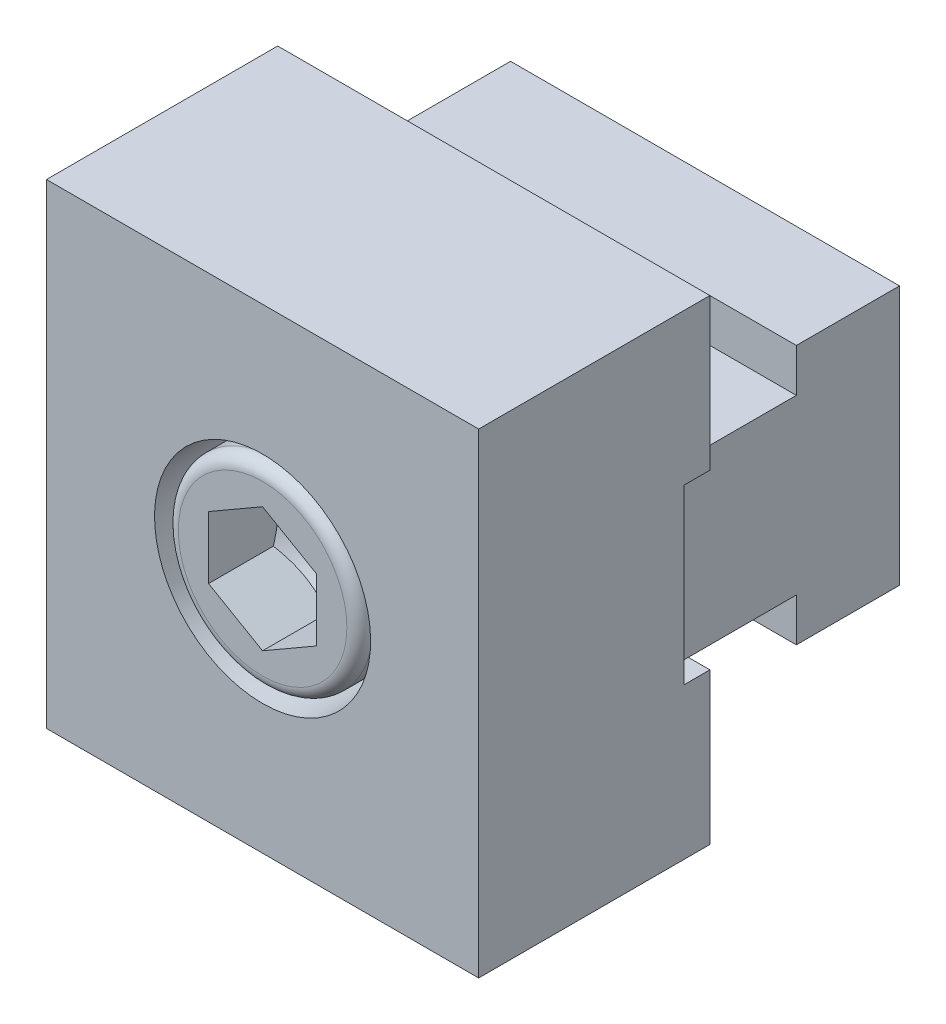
ISO-10303-21;
HEADER;
FILE_DESCRIPTION(('STEP AP214'),'2;1');
FILE_NAME('part.step','',(''),(''),'','','');
FILE_SCHEMA(('AUTOMOTIVE_DESIGN { 1 0 10303 214 1 1 1 1 }'));
ENDSEC;
DATA;
#1=APPLICATION_CONTEXT('core data for automotive mechanical design processes');
#2=APPLICATION_PROTOCOL_DEFINITION('international standard','automotive_design',2000,#1);
#3=PRODUCT_CONTEXT('',#1,'mechanical');
#4=PRODUCT('Part','Part','',(#3));
#5=PRODUCT_RELATED_PRODUCT_CATEGORY('part','',(#4));
#6=PRODUCT_DEFINITION_FORMATION('','',#4);
#7=PRODUCT_DEFINITION_CONTEXT('part definition',#1,'design');
#8=PRODUCT_DEFINITION('design','',#6,#7);
#9=PRODUCT_DEFINITION_SHAPE('','',#8);
#10=(LENGTH_UNIT() NAMED_UNIT(*) SI_UNIT(.MILLI.,.METRE.));
#11=(NAMED_UNIT(*) PLANE_ANGLE_UNIT() SI_UNIT($,.RADIAN.));
#12=(NAMED_UNIT(*) SI_UNIT($,.STERADIAN.) SOLID_ANGLE_UNIT());
#13=UNCERTAINTY_MEASURE_WITH_UNIT(LENGTH_MEASURE(1.E-05),#10,'distance_accuracy_value','');
#14=(GEOMETRIC_REPRESENTATION_CONTEXT(3) GLOBAL_UNCERTAINTY_ASSIGNED_CONTEXT((#13)) GLOBAL_UNIT_ASSIGNED_CONTEXT((#10,
#11,#12)) REPRESENTATION_CONTEXT('',''));
#15=CARTESIAN_POINT('',(0.,0.,0.));
#16=DIRECTION('',(0.,0.,1.));
#17=DIRECTION('',(1.,0.,0.));
#18=AXIS2_PLACEMENT_3D('',#15,#16,#17);
#19=CARTESIAN_POINT('',(0.,0.,-7.7875));
#20=DIRECTION('',(0.,0.,-1.));
#21=DIRECTION('',(-1.,0.,0.));
#22=AXIS2_PLACEMENT_3D('',#19,#20,#21);
#23=CYLINDRICAL_SURFACE('',#22,6.);
#24=CARTESIAN_POINT('',(0.,0.,2.00000000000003));
#25=DIRECTION('',(0.,0.,1.));
#26=DIRECTION('',(0.,-1.,0.));
#27=AXIS2_PLACEMENT_3D('',#24,#25,#26);
#28=CIRCLE('',#27,6.);
#29=CARTESIAN_POINT('',(0.,-5.99999999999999,2.00000000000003));
#30=VERTEX_POINT('',#29);
#31=EDGE_CURVE('E160',#30,#30,#28,.F.);
#32=ORIENTED_EDGE('',*,*,#31,.F.);
#33=EDGE_LOOP('',(#32));
#34=FACE_BOUND('',#33,.T.);
#35=CARTESIAN_POINT('',(0.,0.,2.4));
#36=DIRECTION('',(0.,0.,1.));
#37=DIRECTION('',(1.,0.,0.));
#38=AXIS2_PLACEMENT_3D('',#35,#36,#37);
#39=CIRCLE('',#38,6.);
#40=CARTESIAN_POINT('',(6.,0.,2.4));
#41=VERTEX_POINT('',#40);
#42=EDGE_CURVE('E18',#41,#41,#39,.F.);
#43=ORIENTED_EDGE('',*,*,#42,.T.);
#44=EDGE_LOOP('',(#43));
#45=FACE_BOUND('',#44,.T.);
#46=ADVANCED_FACE('F14',(#34,#45),#23,.T.);
#47=CARTESIAN_POINT('',(-20.,22.,21.4));
#48=DIRECTION('',(0.,0.,1.));
#49=DIRECTION('',(0.,-1.,0.));
#50=AXIS2_PLACEMENT_3D('',#47,#48,#49);
#51=PLANE('',#50);
#52=CARTESIAN_POINT('',(0.,0.,21.4));
#53=DIRECTION('',(0.,0.,1.));
#54=DIRECTION('',(0.,-1.,0.));
#55=AXIS2_PLACEMENT_3D('',#52,#53,#54);
#56=CIRCLE('',#55,10.);
#57=CARTESIAN_POINT('',(0.,-9.99999999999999,21.4));
#58=VERTEX_POINT('',#57);
#59=EDGE_CURVE('E319',#58,#58,#56,.F.);
#60=ORIENTED_EDGE('',*,*,#59,.T.);
#61=EDGE_LOOP('',(#60));
#62=FACE_BOUND('',#61,.T.);
#63=DIRECTION('',(0.,-1.,0.));
#64=VECTOR('',#63,1.);
#65=CARTESIAN_POINT('',(20.,22.,21.4));
#66=LINE('',#65,#64);
#67=CARTESIAN_POINT('',(20.,-22.,21.4));
#68=VERTEX_POINT('',#67);
#69=CARTESIAN_POINT('',(20.,22.,21.4));
#70=VERTEX_POINT('',#69);
#71=EDGE_CURVE('E314',#68,#70,#66,.F.);
#72=ORIENTED_EDGE('',*,*,#71,.T.);
#73=DIRECTION('',(1.,0.,0.));
#74=VECTOR('',#73,1.);
#75=CARTESIAN_POINT('',(-20.,22.,21.4));
#76=LINE('',#75,#74);
#77=CARTESIAN_POINT('',(-20.,22.,21.4));
#78=VERTEX_POINT('',#77);
#79=EDGE_CURVE('E317',#70,#78,#76,.F.);
#80=ORIENTED_EDGE('',*,*,#79,.T.);
#81=DIRECTION('',(0.,-1.,0.));
#82=VECTOR('',#81,1.);
#83=CARTESIAN_POINT('',(-20.,22.,21.4));
#84=LINE('',#83,#82);
#85=CARTESIAN_POINT('',(-20.,-22.,21.4));
#86=VERTEX_POINT('',#85);
#87=EDGE_CURVE('E308',#78,#86,#84,.T.);
#88=ORIENTED_EDGE('',*,*,#87,.T.);
#89=DIRECTION('',(1.,0.,0.));
#90=VECTOR('',#89,1.);
#91=CARTESIAN_POINT('',(-20.,-22.,21.4));
#92=LINE('',#91,#90);
#93=EDGE_CURVE('E311',#86,#68,#92,.T.);
#94=ORIENTED_EDGE('',*,*,#93,.T.);
#95=EDGE_LOOP('',(#72,#80,#88,#94));
#96=FACE_BOUND('',#95,.T.);
#97=ADVANCED_FACE('F477',(#62,#96),#51,.T.);
#98=CARTESIAN_POINT('',(0.,0.,15.4));
#99=DIRECTION('',(0.,0.,1.));
#100=DIRECTION('',(0.,-1.,0.));
#101=AXIS2_PLACEMENT_3D('',#98,#99,#100);
#102=CYLINDRICAL_SURFACE('',#101,10.);
#103=CARTESIAN_POINT('',(0.,0.,9.4));
#104=DIRECTION('',(0.,0.,1.));
#105=DIRECTION('',(0.,-1.,0.));
#106=AXIS2_PLACEMENT_3D('',#103,#104,#105);
#107=CIRCLE('',#106,10.);
#108=CARTESIAN_POINT('',(0.,-9.99999999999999,9.4));
#109=VERTEX_POINT('',#108);
#110=EDGE_CURVE('E307',#109,#109,#107,.T.);
#111=ORIENTED_EDGE('',*,*,#110,.F.);
#112=EDGE_LOOP('',(#111));
#113=FACE_BOUND('',#112,.T.);
#114=ORIENTED_EDGE('',*,*,#59,.F.);
#115=EDGE_LOOP('',(#114));
#116=FACE_BOUND('',#115,.T.);
#117=ADVANCED_FACE('F483',(#113,#116),#102,.F.);
#118=CARTESIAN_POINT('',(0.,0.,9.4));
#119=DIRECTION('',(0.,0.,1.));
#120=DIRECTION('',(0.,-1.,0.));
#121=AXIS2_PLACEMENT_3D('',#118,#119,#120);
#122=PLANE('',#121);
#123=ORIENTED_EDGE('',*,*,#110,.T.);
#124=EDGE_LOOP('',(#123));
#125=FACE_BOUND('',#124,.T.);
#126=CARTESIAN_POINT('',(0.,0.,9.4));
#127=DIRECTION('',(0.,0.,-1.));
#128=DIRECTION('',(-1.,0.,0.));
#129=AXIS2_PLACEMENT_3D('',#126,#127,#128);
#130=CIRCLE('',#129,9.);
#131=CARTESIAN_POINT('',(-9.,0.,9.4));
#132=VERTEX_POINT('',#131);
#133=EDGE_CURVE('E324',#132,#132,#130,.T.);
#134=ORIENTED_EDGE('',*,*,#133,.T.);
#135=EDGE_LOOP('',(#134));
#136=FACE_BOUND('',#135,.T.);
#137=ADVANCED_FACE('F607',(#125,#136),#122,.T.);
#138=CARTESIAN_POINT('',(-20.,-22.,-1.6));
#139=DIRECTION('',(0.,1.,0.));
#140=DIRECTION('',(0.,0.,1.));
#141=AXIS2_PLACEMENT_3D('',#138,#139,#140);
#142=PLANE('',#141);
#143=DIRECTION('',(0.,0.,1.));
#144=VECTOR('',#143,1.);
#145=CARTESIAN_POINT('',(20.,-22.,9.9));
#146=LINE('',#145,#144);
#147=CARTESIAN_POINT('',(20.,-22.,0.));
#148=VERTEX_POINT('',#147);
#149=EDGE_CURVE('E295',#68,#148,#146,.F.);
#150=ORIENTED_EDGE('',*,*,#149,.F.);
#151=ORIENTED_EDGE('',*,*,#93,.F.);
#152=DIRECTION('',(0.,0.,1.));
#153=VECTOR('',#152,1.);
#154=CARTESIAN_POINT('',(-20.,-22.,-1.6));
#155=LINE('',#154,#153);
#156=CARTESIAN_POINT('',(-20.,-22.,0.));
#157=VERTEX_POINT('',#156);
#158=EDGE_CURVE('E275',#157,#86,#155,.T.);
#159=ORIENTED_EDGE('',*,*,#158,.F.);
#160=DIRECTION('',(1.,0.,0.));
#161=VECTOR('',#160,1.);
#162=CARTESIAN_POINT('',(-20.,-22.,0.));
#163=LINE('',#162,#161);
#164=EDGE_CURVE('E278',#148,#157,#163,.F.);
#165=ORIENTED_EDGE('',*,*,#164,.F.);
#166=EDGE_LOOP('',(#150,#151,#159,#165));
#167=FACE_BOUND('',#166,.T.);
#168=ADVANCED_FACE('F598',(#167),#142,.F.);
#169=CARTESIAN_POINT('',(-20.,8.,2.4));
#170=DIRECTION('',(0.,0.,1.));
#171=DIRECTION('',(0.,-1.,0.));
#172=AXIS2_PLACEMENT_3D('',#169,#170,#171);
#173=PLANE('',#172);
#174=DIRECTION('',(0.,-1.,0.));
#175=VECTOR('',#174,1.);
#176=CARTESIAN_POINT('',(20.,11.,2.4));
#177=LINE('',#176,#175);
#178=CARTESIAN_POINT('',(20.,-8.,2.4));
#179=VERTEX_POINT('',#178);
#180=CARTESIAN_POINT('',(20.,8.,2.4));
#181=VERTEX_POINT('',#180);
#182=EDGE_CURVE('E286',#179,#181,#177,.F.);
#183=ORIENTED_EDGE('',*,*,#182,.F.);
#184=DIRECTION('',(1.,0.,0.));
#185=VECTOR('',#184,1.);
#186=CARTESIAN_POINT('',(-20.,-8.,2.4));
#187=LINE('',#186,#185);
#188=CARTESIAN_POINT('',(-20.,-8.,2.4));
#189=VERTEX_POINT('',#188);
#190=EDGE_CURVE('E249',#189,#179,#187,.T.);
#191=ORIENTED_EDGE('',*,*,#190,.F.);
#192=DIRECTION('',(0.,-1.,0.));
#193=VECTOR('',#192,1.);
#194=CARTESIAN_POINT('',(-20.,11.,2.4));
#195=LINE('',#194,#193);
#196=CARTESIAN_POINT('',(-20.,8.,2.4));
#197=VERTEX_POINT('',#196);
#198=EDGE_CURVE('E265',#189,#197,#195,.F.);
#199=ORIENTED_EDGE('',*,*,#198,.T.);
#200=DIRECTION('',(1.,0.,0.));
#201=VECTOR('',#200,1.);
#202=CARTESIAN_POINT('',(-20.,8.,2.4));
#203=LINE('',#202,#201);
#204=EDGE_CURVE('E252',#197,#181,#203,.T.);
#205=ORIENTED_EDGE('',*,*,#204,.T.);
#206=EDGE_LOOP('',(#183,#191,#199,#205));
#207=FACE_BOUND('',#206,.T.);
#208=ORIENTED_EDGE('',*,*,#42,.F.);
#209=EDGE_LOOP('',(#208));
#210=FACE_BOUND('',#209,.T.);
#211=ADVANCED_FACE('F592',(#207,#210),#173,.F.);
#212=CARTESIAN_POINT('',(-20.,8.,-1.6));
#213=DIRECTION('',(0.,1.,0.));
#214=DIRECTION('',(0.,0.,1.));
#215=AXIS2_PLACEMENT_3D('',#212,#213,#214);
#216=PLANE('',#215);
#217=DIRECTION('',(1.,0.,0.));
#218=VECTOR('',#217,1.);
#219=CARTESIAN_POINT('',(-20.,8.,2.00000000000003));
#220=LINE('',#219,#218);
#221=CARTESIAN_POINT('',(-18.,8.,2.00000000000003));
#222=VERTEX_POINT('',#221);
#223=CARTESIAN_POINT('',(18.,8.,2.00000000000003));
#224=VERTEX_POINT('',#223);
#225=EDGE_CURVE('E212',#222,#224,#220,.T.);
#226=ORIENTED_EDGE('',*,*,#225,.T.);
#227=DIRECTION('',(0.,0.,-1.));
#228=VECTOR('',#227,1.);
#229=CARTESIAN_POINT('',(18.,8.,-1.6));
#230=LINE('',#229,#228);
#231=CARTESIAN_POINT('',(18.,8.,0.));
#232=VERTEX_POINT('',#231);
#233=EDGE_CURVE('E205',#224,#232,#230,.T.);
#234=ORIENTED_EDGE('',*,*,#233,.T.);
#235=DIRECTION('',(1.,0.,0.));
#236=VECTOR('',#235,1.);
#237=CARTESIAN_POINT('',(-20.,8.,0.));
#238=LINE('',#237,#236);
#239=CARTESIAN_POINT('',(20.,8.,0.));
#240=VERTEX_POINT('',#239);
#241=EDGE_CURVE('E257',#232,#240,#238,.T.);
#242=ORIENTED_EDGE('',*,*,#241,.T.);
#243=DIRECTION('',(0.,0.,1.));
#244=VECTOR('',#243,1.);
#245=CARTESIAN_POINT('',(20.,8.,9.9));
#246=LINE('',#245,#244);
#247=EDGE_CURVE('E289',#181,#240,#246,.F.);
#248=ORIENTED_EDGE('',*,*,#247,.F.);
#249=ORIENTED_EDGE('',*,*,#204,.F.);
#250=DIRECTION('',(0.,0.,1.));
#251=VECTOR('',#250,1.);
#252=CARTESIAN_POINT('',(-20.,8.,9.9));
#253=LINE('',#252,#251);
#254=CARTESIAN_POINT('',(-20.,8.,0.));
#255=VERTEX_POINT('',#254);
#256=EDGE_CURVE('E268',#197,#255,#253,.F.);
#257=ORIENTED_EDGE('',*,*,#256,.T.);
#258=CARTESIAN_POINT('',(-18.,8.,0.));
#259=VERTEX_POINT('',#258);
#260=EDGE_CURVE('E260',#255,#259,#238,.T.);
#261=ORIENTED_EDGE('',*,*,#260,.T.);
#262=DIRECTION('',(0.,0.,1.));
#263=VECTOR('',#262,1.);
#264=CARTESIAN_POINT('',(-18.,8.,-1.6));
#265=LINE('',#264,#263);
#266=EDGE_CURVE('E333',#259,#222,#265,.T.);
#267=ORIENTED_EDGE('',*,*,#266,.T.);
#268=EDGE_LOOP('',(#226,#234,#242,#248,#249,#257,#261,#267));
#269=FACE_BOUND('',#268,.T.);
#270=ADVANCED_FACE('F548',(#269),#216,.F.);
#271=CARTESIAN_POINT('',(20.,11.,9.9));
#272=DIRECTION('',(1.,0.,0.));
#273=DIRECTION('',(0.,0.,1.));
#274=AXIS2_PLACEMENT_3D('',#271,#272,#273);
#275=PLANE('',#274);
#276=ORIENTED_EDGE('',*,*,#71,.F.);
#277=ORIENTED_EDGE('',*,*,#149,.T.);
#278=DIRECTION('',(0.,-1.,0.));
#279=VECTOR('',#278,1.);
#280=CARTESIAN_POINT('',(20.,11.,0.));
#281=LINE('',#280,#279);
#282=CARTESIAN_POINT('',(20.,-8.,0.));
#283=VERTEX_POINT('',#282);
#284=EDGE_CURVE('E280',#148,#283,#281,.F.);
#285=ORIENTED_EDGE('',*,*,#284,.T.);
#286=DIRECTION('',(0.,0.,1.));
#287=VECTOR('',#286,1.);
#288=CARTESIAN_POINT('',(20.,-8.,9.9));
#289=LINE('',#288,#287);
#290=EDGE_CURVE('E283',#283,#179,#289,.T.);
#291=ORIENTED_EDGE('',*,*,#290,.T.);
#292=ORIENTED_EDGE('',*,*,#182,.T.);
#293=ORIENTED_EDGE('',*,*,#247,.T.);
#294=DIRECTION('',(0.,-1.,0.));
#295=VECTOR('',#294,1.);
#296=CARTESIAN_POINT('',(20.,11.,0.));
#297=LINE('',#296,#295);
#298=CARTESIAN_POINT('',(20.,22.,0.));
#299=VERTEX_POINT('',#298);
#300=EDGE_CURVE('E292',#240,#299,#297,.F.);
#301=ORIENTED_EDGE('',*,*,#300,.T.);
#302=DIRECTION('',(0.,0.,1.));
#303=VECTOR('',#302,1.);
#304=CARTESIAN_POINT('',(20.,22.,-1.6));
#305=LINE('',#304,#303);
#306=EDGE_CURVE('E304',#70,#299,#305,.F.);
#307=ORIENTED_EDGE('',*,*,#306,.F.);
#308=EDGE_LOOP('',(#276,#277,#285,#291,#292,#293,#301,#307));
#309=FACE_BOUND('',#308,.T.);
#310=ADVANCED_FACE('F575',(#309),#275,.T.);
#311=CARTESIAN_POINT('',(-20.,22.,-1.6));
#312=DIRECTION('',(0.,1.,0.));
#313=DIRECTION('',(0.,0.,1.));
#314=AXIS2_PLACEMENT_3D('',#311,#312,#313);
#315=PLANE('',#314);
#316=ORIENTED_EDGE('',*,*,#79,.F.);
#317=ORIENTED_EDGE('',*,*,#306,.T.);
#318=DIRECTION('',(1.,0.,0.));
#319=VECTOR('',#318,1.);
#320=CARTESIAN_POINT('',(-20.,22.,0.));
#321=LINE('',#320,#319);
#322=CARTESIAN_POINT('',(-20.,22.,0.));
#323=VERTEX_POINT('',#322);
#324=EDGE_CURVE('E298',#299,#323,#321,.F.);
#325=ORIENTED_EDGE('',*,*,#324,.T.);
#326=DIRECTION('',(0.,0.,1.));
#327=VECTOR('',#326,1.);
#328=CARTESIAN_POINT('',(-20.,22.,-1.6));
#329=LINE('',#328,#327);
#330=EDGE_CURVE('E301',#323,#78,#329,.T.);
#331=ORIENTED_EDGE('',*,*,#330,.T.);
#332=EDGE_LOOP('',(#316,#317,#325,#331));
#333=FACE_BOUND('',#332,.T.);
#334=ADVANCED_FACE('F568',(#333),#315,.T.);
#335=CARTESIAN_POINT('',(-20.,11.,9.9));
#336=DIRECTION('',(1.,0.,0.));
#337=DIRECTION('',(0.,0.,1.));
#338=AXIS2_PLACEMENT_3D('',#335,#336,#337);
#339=PLANE('',#338);
#340=ORIENTED_EDGE('',*,*,#158,.T.);
#341=ORIENTED_EDGE('',*,*,#87,.F.);
#342=ORIENTED_EDGE('',*,*,#330,.F.);
#343=DIRECTION('',(0.,-1.,0.));
#344=VECTOR('',#343,1.);
#345=CARTESIAN_POINT('',(-20.,11.,0.));
#346=LINE('',#345,#344);
#347=EDGE_CURVE('E271',#255,#323,#346,.F.);
#348=ORIENTED_EDGE('',*,*,#347,.F.);
#349=ORIENTED_EDGE('',*,*,#256,.F.);
#350=ORIENTED_EDGE('',*,*,#198,.F.);
#351=DIRECTION('',(0.,0.,1.));
#352=VECTOR('',#351,1.);
#353=CARTESIAN_POINT('',(-20.,-8.,9.9));
#354=LINE('',#353,#352);
#355=CARTESIAN_POINT('',(-20.,-8.,0.));
#356=VERTEX_POINT('',#355);
#357=EDGE_CURVE('E263',#356,#189,#354,.T.);
#358=ORIENTED_EDGE('',*,*,#357,.F.);
#359=DIRECTION('',(0.,-1.,0.));
#360=VECTOR('',#359,1.);
#361=CARTESIAN_POINT('',(-20.,11.,0.));
#362=LINE('',#361,#360);
#363=EDGE_CURVE('E243',#157,#356,#362,.F.);
#364=ORIENTED_EDGE('',*,*,#363,.F.);
#365=EDGE_LOOP('',(#340,#341,#342,#348,#349,#350,#358,#364));
#366=FACE_BOUND('',#365,.T.);
#367=ADVANCED_FACE('F562',(#366),#339,.F.);
#368=CARTESIAN_POINT('',(-20.,-22.,0.));
#369=DIRECTION('',(0.,0.,1.));
#370=DIRECTION('',(0.,-1.,0.));
#371=AXIS2_PLACEMENT_3D('',#368,#369,#370);
#372=PLANE('',#371);
#373=ORIENTED_EDGE('',*,*,#347,.T.);
#374=ORIENTED_EDGE('',*,*,#324,.F.);
#375=ORIENTED_EDGE('',*,*,#300,.F.);
#376=ORIENTED_EDGE('',*,*,#241,.F.);
#377=EDGE_CURVE('E136',#259,#232,#238,.T.);
#378=ORIENTED_EDGE('',*,*,#377,.F.);
#379=ORIENTED_EDGE('',*,*,#260,.F.);
#380=EDGE_LOOP('',(#373,#374,#375,#376,#378,#379));
#381=FACE_BOUND('',#380,.T.);
#382=ADVANCED_FACE('F554',(#381),#372,.F.);
#383=CARTESIAN_POINT('',(-20.,-22.,0.));
#384=DIRECTION('',(0.,0.,1.));
#385=DIRECTION('',(0.,-1.,0.));
#386=AXIS2_PLACEMENT_3D('',#383,#384,#385);
#387=PLANE('',#386);
#388=ORIENTED_EDGE('',*,*,#284,.F.);
#389=ORIENTED_EDGE('',*,*,#164,.T.);
#390=ORIENTED_EDGE('',*,*,#363,.T.);
#391=DIRECTION('',(1.,0.,0.));
#392=VECTOR('',#391,1.);
#393=CARTESIAN_POINT('',(-20.,-8.,0.));
#394=LINE('',#393,#392);
#395=CARTESIAN_POINT('',(-18.,-8.,0.));
#396=VERTEX_POINT('',#395);
#397=EDGE_CURVE('E227',#396,#356,#394,.F.);
#398=ORIENTED_EDGE('',*,*,#397,.F.);
#399=CARTESIAN_POINT('',(18.,-8.,0.));
#400=VERTEX_POINT('',#399);
#401=EDGE_CURVE('E232',#400,#396,#394,.F.);
#402=ORIENTED_EDGE('',*,*,#401,.F.);
#403=EDGE_CURVE('E236',#283,#400,#394,.F.);
#404=ORIENTED_EDGE('',*,*,#403,.F.);
#405=EDGE_LOOP('',(#388,#389,#390,#398,#402,#404));
#406=FACE_BOUND('',#405,.T.);
#407=ADVANCED_FACE('F240',(#406),#387,.F.);
#408=CARTESIAN_POINT('',(-20.,-8.,-1.6));
#409=DIRECTION('',(0.,1.,0.));
#410=DIRECTION('',(0.,0.,1.));
#411=AXIS2_PLACEMENT_3D('',#408,#409,#410);
#412=PLANE('',#411);
#413=DIRECTION('',(0.,0.,1.));
#414=VECTOR('',#413,1.);
#415=CARTESIAN_POINT('',(18.,-8.,-9.49031612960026));
#416=LINE('',#415,#414);
#417=CARTESIAN_POINT('',(18.,-8.,2.00000000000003));
#418=VERTEX_POINT('',#417);
#419=EDGE_CURVE('E9',#418,#400,#416,.F.);
#420=ORIENTED_EDGE('',*,*,#419,.F.);
#421=DIRECTION('',(1.,0.,0.));
#422=VECTOR('',#421,1.);
#423=CARTESIAN_POINT('',(-20.,-8.,2.00000000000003));
#424=LINE('',#423,#422);
#425=CARTESIAN_POINT('',(-18.,-8.,2.00000000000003));
#426=VERTEX_POINT('',#425);
#427=EDGE_CURVE('E213',#426,#418,#424,.T.);
#428=ORIENTED_EDGE('',*,*,#427,.F.);
#429=DIRECTION('',(0.,0.,1.));
#430=VECTOR('',#429,1.);
#431=CARTESIAN_POINT('',(-18.,-8.,-1.6));
#432=LINE('',#431,#430);
#433=EDGE_CURVE('E24',#396,#426,#432,.T.);
#434=ORIENTED_EDGE('',*,*,#433,.F.);
#435=ORIENTED_EDGE('',*,*,#397,.T.);
#436=ORIENTED_EDGE('',*,*,#357,.T.);
#437=ORIENTED_EDGE('',*,*,#190,.T.);
#438=ORIENTED_EDGE('',*,*,#290,.F.);
#439=ORIENTED_EDGE('',*,*,#403,.T.);
#440=EDGE_LOOP('',(#420,#428,#434,#435,#436,#437,#438,#439));
#441=FACE_BOUND('',#440,.T.);
#442=ADVANCED_FACE('F224',(#441),#412,.T.);
#443=CARTESIAN_POINT('',(0.,0.,15.4199999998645));
#444=DIRECTION('',(0.,0.,1.));
#445=DIRECTION('',(0.,1.,0.));
#446=AXIS2_PLACEMENT_3D('',#443,#444,#445);
#447=CONICAL_SURFACE('',#446,5.80814370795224,1.04719755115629);
#448=CARTESIAN_POINT('',(1.13684669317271E-10,0.,12.0666666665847));
#449=VERTEX_POINT('',#448);
#450=VERTEX_LOOP('',#449);
#451=FACE_BOUND('',#450,.T.);
#452=CARTESIAN_POINT('',(-4.99999999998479,2.88675134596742,15.3999999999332));
#453=CARTESIAN_POINT('',(-4.99999999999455,2.63302758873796,15.3267433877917));
#454=CARTESIAN_POINT('',(-4.99999999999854,2.37713371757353,15.2601139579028));
#455=CARTESIAN_POINT('',(-5.00000000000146,1.86091527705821,15.1438136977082));
#456=CARTESIAN_POINT('',(-5.00000000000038,1.60058153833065,15.0941840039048));
#457=CARTESIAN_POINT('',(-4.99999999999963,1.08310061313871,15.0169443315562));
#458=CARTESIAN_POINT('',(-4.99999999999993,0.826034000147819,14.9888198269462));
#459=CARTESIAN_POINT('',(-5.00000000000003,0.439530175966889,14.9636032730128));
#460=CARTESIAN_POINT('',(-5.00000000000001,0.310607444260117,14.9580247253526));
#461=CARTESIAN_POINT('',(-4.99999999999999,0.0526429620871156,14.9526191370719));
#462=CARTESIAN_POINT('',(-5.,-0.0763987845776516,14.9527919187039));
#463=CARTESIAN_POINT('',(-5.00000000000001,-0.429906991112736,14.9611797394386));
#464=CARTESIAN_POINT('',(-5.,-0.654256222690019,14.975256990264));
#465=CARTESIAN_POINT('',(-4.99999999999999,-1.10146575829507,15.0198894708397));
#466=CARTESIAN_POINT('',(-5.,-1.32432449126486,15.0504599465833));
#467=CARTESIAN_POINT('',(-5.,-1.77243449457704,15.1268756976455));
#468=CARTESIAN_POINT('',(-5.,-1.99762923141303,15.1730446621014));
#469=CARTESIAN_POINT('',(-5.,-2.44466090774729,15.2778288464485));
#470=CARTESIAN_POINT('',(-5.,-2.666503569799,15.3364194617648));
#471=CARTESIAN_POINT('',(-5.,-2.88675134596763,15.3999999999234));
#472=B_SPLINE_CURVE_WITH_KNOTS('',3,(#452,#453,#454,#455,#456,#457,#458,#459,#460,#461,#462,
#463,#464,#465,#466,#467,#468,#469,#470,#471),.UNSPECIFIED.,.F.,.F.,(4,2,2,2,2,2,2,2,2,4),(0.,
0.79254002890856,1.58698454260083,2.36176901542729,2.7487873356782,3.13579369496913,
3.80946092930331,4.48375195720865,5.17299552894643,5.86088640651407),.UNSPECIFIED.);
#473=CARTESIAN_POINT('',(-5.0000000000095,2.88675134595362,15.399999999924));
#474=VERTEX_POINT('',#473);
#475=CARTESIAN_POINT('',(-5.,-2.88675134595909,15.3999999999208));
#476=VERTEX_POINT('',#475);
#477=EDGE_CURVE('E165',#474,#476,#472,.T.);
#478=ORIENTED_EDGE('',*,*,#477,.T.);
#479=CARTESIAN_POINT('',(-5.00000000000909,-2.8867513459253,15.3999999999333));
#480=CARTESIAN_POINT('',(-4.78026878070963,-3.01361322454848,15.3267433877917));
#481=CARTESIAN_POINT('',(-4.55865818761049,-3.14156016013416,15.2601139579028));
#482=CARTESIAN_POINT('',(-4.1115999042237,-3.39966938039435,15.1438136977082));
#483=CARTESIAN_POINT('',(-3.8861442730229,-3.52983624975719,15.0941840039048));
#484=CARTESIAN_POINT('',(-3.43799264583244,-3.78857671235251,15.0169443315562));
#485=CARTESIAN_POINT('',(-3.21536642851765,-3.91711001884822,14.9888198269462));
#486=CARTESIAN_POINT('',(-2.88064429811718,-4.11036193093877,14.9636032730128));
#487=CARTESIAN_POINT('',(-2.76899393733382,-4.17482329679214,14.9580247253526));
#488=CARTESIAN_POINT('',(-2.54559014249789,-4.30380553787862,14.9526191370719));
#489=CARTESIAN_POINT('',(-2.43383671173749,-4.36832641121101,14.9527919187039));
#490=CARTESIAN_POINT('',(-2.12768962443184,-4.54508051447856,14.9611797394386));
#491=CARTESIAN_POINT('',(-1.93339749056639,-4.6572551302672,14.975256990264));
#492=CARTESIAN_POINT('',(-1.54610267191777,-4.88085989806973,15.0198894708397));
#493=CARTESIAN_POINT('',(-1.35310134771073,-4.99228926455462,15.0504599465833));
#494=CARTESIAN_POINT('',(-0.965026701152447,-5.21634426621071,15.1268756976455));
#495=CARTESIAN_POINT('',(-0.770002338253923,-5.32894163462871,15.1730446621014));
#496=CARTESIAN_POINT('',(-0.382861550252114,-5.55245747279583,15.2778288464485));
#497=CARTESIAN_POINT('',(-0.190740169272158,-5.66337880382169,15.3364194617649));
#498=CARTESIAN_POINT('',(1.6904880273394E-11,-5.77350269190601,15.3999999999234));
#499=B_SPLINE_CURVE_WITH_KNOTS('',3,(#479,#480,#481,#482,#483,#484,#485,#486,#487,#488,#489,
#490,#491,#492,#493,#494,#495,#496,#497,#498),.UNSPECIFIED.,.F.,.F.,(4,2,2,2,2,2,2,2,2,4),(0.,
0.792540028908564,1.58698454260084,2.3617690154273,2.74878733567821,3.13579369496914,
3.80946092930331,4.48375195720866,5.17299552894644,5.86088640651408),.UNSPECIFIED.);
#500=CARTESIAN_POINT('',(0.,-5.77350269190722,15.399999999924));
#501=VERTEX_POINT('',#500);
#502=EDGE_CURVE('E378',#476,#501,#499,.T.);
#503=ORIENTED_EDGE('',*,*,#502,.T.);
#504=CARTESIAN_POINT('',(-2.43000064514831E-11,-5.77350269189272,15.3999999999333));
#505=CARTESIAN_POINT('',(0.219731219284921,-5.64664081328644,15.3267433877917));
#506=CARTESIAN_POINT('',(0.441341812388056,-5.51869387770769,15.2601139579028));
#507=CARTESIAN_POINT('',(0.888400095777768,-5.26058465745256,15.1438136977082));
#508=CARTESIAN_POINT('',(1.11385572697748,-5.13041778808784,15.0941840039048));
#509=CARTESIAN_POINT('',(1.56200735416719,-4.87167732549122,15.0169443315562));
#510=CARTESIAN_POINT('',(1.78463357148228,-4.74314401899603,14.9888198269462));
#511=CARTESIAN_POINT('',(2.11935570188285,-4.54989210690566,14.9636032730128));
#512=CARTESIAN_POINT('',(2.23100606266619,-4.48543074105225,14.9580247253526));
#513=CARTESIAN_POINT('',(2.4544098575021,-4.35644849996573,14.9526191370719));
#514=CARTESIAN_POINT('',(2.56616328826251,-4.29192762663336,14.9527919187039));
#515=CARTESIAN_POINT('',(2.87231037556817,-4.11517352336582,14.9611797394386));
#516=CARTESIAN_POINT('',(3.06660250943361,-4.00299890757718,14.975256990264));
#517=CARTESIAN_POINT('',(3.45389732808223,-3.77939413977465,15.0198894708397));
#518=CARTESIAN_POINT('',(3.64689865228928,-3.66796477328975,15.0504599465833));
#519=CARTESIAN_POINT('',(4.03497329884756,-3.44390977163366,15.1268756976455));
#520=CARTESIAN_POINT('',(4.22999766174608,-3.33131240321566,15.1730446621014));
#521=CARTESIAN_POINT('',(4.61713844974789,-3.10779656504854,15.2778288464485));
#522=CARTESIAN_POINT('',(4.80925983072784,-2.99687523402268,15.3364194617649));
#523=CARTESIAN_POINT('',(5.00000000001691,-2.88675134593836,15.3999999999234));
#524=B_SPLINE_CURVE_WITH_KNOTS('',3,(#504,#505,#506,#507,#508,#509,#510,#511,#512,#513,#514,
#515,#516,#517,#518,#519,#520,#521,#522,#523),.UNSPECIFIED.,.F.,.F.,(4,2,2,2,2,2,2,2,2,4),(0.,
0.792540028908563,1.58698454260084,2.3617690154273,2.74878733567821,3.13579369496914,
3.80946092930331,4.48375195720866,5.17299552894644,5.86088640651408),.UNSPECIFIED.);
#525=CARTESIAN_POINT('',(5.0000000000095,-2.8867513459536,15.399999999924));
#526=VERTEX_POINT('',#525);
#527=EDGE_CURVE('E381',#501,#526,#524,.T.);
#528=ORIENTED_EDGE('',*,*,#527,.T.);
#529=CARTESIAN_POINT('',(4.99999999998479,-2.8867513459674,15.3999999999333));
#530=CARTESIAN_POINT('',(4.99999999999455,-2.63302758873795,15.3267433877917));
#531=CARTESIAN_POINT('',(4.99999999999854,-2.37713371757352,15.2601139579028));
#532=CARTESIAN_POINT('',(5.00000000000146,-1.8609152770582,15.1438136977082));
#533=CARTESIAN_POINT('',(5.00000000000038,-1.60058153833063,15.0941840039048));
#534=CARTESIAN_POINT('',(4.99999999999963,-1.0831006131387,15.0169443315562));
#535=CARTESIAN_POINT('',(4.99999999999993,-0.826034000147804,14.9888198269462));
#536=CARTESIAN_POINT('',(5.00000000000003,-0.439530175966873,14.9636032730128));
#537=CARTESIAN_POINT('',(5.00000000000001,-0.310607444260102,14.9580247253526));
#538=CARTESIAN_POINT('',(4.99999999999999,-0.0526429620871,14.9526191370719));
#539=CARTESIAN_POINT('',(5.,0.0763987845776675,14.9527919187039));
#540=CARTESIAN_POINT('',(5.00000000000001,0.429906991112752,14.9611797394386));
#541=CARTESIAN_POINT('',(5.,0.654256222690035,14.975256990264));
#542=CARTESIAN_POINT('',(5.,1.10146575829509,15.0198894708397));
#543=CARTESIAN_POINT('',(5.,1.32432449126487,15.0504599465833));
#544=CARTESIAN_POINT('',(5.,1.77243449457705,15.1268756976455));
#545=CARTESIAN_POINT('',(5.,1.99762923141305,15.1730446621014));
#546=CARTESIAN_POINT('',(5.,2.4446609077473,15.2778288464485));
#547=CARTESIAN_POINT('',(5.,2.66650356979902,15.3364194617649));
#548=CARTESIAN_POINT('',(5.,2.88675134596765,15.3999999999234));
#549=B_SPLINE_CURVE_WITH_KNOTS('',3,(#529,#530,#531,#532,#533,#534,#535,#536,#537,#538,#539,
#540,#541,#542,#543,#544,#545,#546,#547,#548),.UNSPECIFIED.,.F.,.F.,(4,2,2,2,2,2,2,2,2,4),(0.,
0.792540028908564,1.58698454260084,2.3617690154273,2.74878733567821,3.13579369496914,
3.80946092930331,4.48375195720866,5.17299552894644,5.86088640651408),.UNSPECIFIED.);
#550=CARTESIAN_POINT('',(5.0000000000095,2.88675134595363,15.399999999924));
#551=VERTEX_POINT('',#550);
#552=EDGE_CURVE('E384',#526,#551,#549,.T.);
#553=ORIENTED_EDGE('',*,*,#552,.T.);
#554=CARTESIAN_POINT('',(5.00000000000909,2.88675134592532,15.3999999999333));
#555=CARTESIAN_POINT('',(4.78026878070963,3.01361322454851,15.3267433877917));
#556=CARTESIAN_POINT('',(4.55865818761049,3.14156016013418,15.2601139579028));
#557=CARTESIAN_POINT('',(4.1115999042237,3.39966938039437,15.1438136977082));
#558=CARTESIAN_POINT('',(3.8861442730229,3.52983624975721,15.0941840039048));
#559=CARTESIAN_POINT('',(3.43799264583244,3.78857671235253,15.0169443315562));
#560=CARTESIAN_POINT('',(3.21536642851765,3.91711001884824,14.9888198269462));
#561=CARTESIAN_POINT('',(2.88064429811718,4.11036193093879,14.9636032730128));
#562=CARTESIAN_POINT('',(2.76899393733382,4.17482329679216,14.9580247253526));
#563=CARTESIAN_POINT('',(2.54559014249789,4.30380553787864,14.9526191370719));
#564=CARTESIAN_POINT('',(2.43383671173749,4.36832641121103,14.9527919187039));
#565=CARTESIAN_POINT('',(2.12768962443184,4.54508051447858,14.9611797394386));
#566=CARTESIAN_POINT('',(1.93339749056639,4.65725513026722,14.975256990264));
#567=CARTESIAN_POINT('',(1.54610267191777,4.88085989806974,15.0198894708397));
#568=CARTESIAN_POINT('',(1.35310134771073,4.99228926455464,15.0504599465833));
#569=CARTESIAN_POINT('',(0.965026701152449,5.21634426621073,15.1268756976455));
#570=CARTESIAN_POINT('',(0.770002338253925,5.32894163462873,15.1730446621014));
#571=CARTESIAN_POINT('',(0.382861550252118,5.55245747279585,15.2778288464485));
#572=CARTESIAN_POINT('',(0.190740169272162,5.66337880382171,15.3364194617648));
#573=CARTESIAN_POINT('',(-1.69001097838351E-11,5.77350269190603,15.3999999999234));
#574=B_SPLINE_CURVE_WITH_KNOTS('',3,(#554,#555,#556,#557,#558,#559,#560,#561,#562,#563,#564,
#565,#566,#567,#568,#569,#570,#571,#572,#573),.UNSPECIFIED.,.F.,.F.,(4,2,2,2,2,2,2,2,2,4),(0.,
0.792540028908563,1.58698454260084,2.3617690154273,2.74878733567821,3.13579369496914,
3.80946092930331,4.48375195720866,5.17299552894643,5.86088640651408),.UNSPECIFIED.);
#575=CARTESIAN_POINT('',(0.,5.77350269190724,15.399999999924));
#576=VERTEX_POINT('',#575);
#577=EDGE_CURVE('E387',#551,#576,#574,.T.);
#578=ORIENTED_EDGE('',*,*,#577,.T.);
#579=CARTESIAN_POINT('',(2.4304776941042E-11,5.77350269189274,15.3999999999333));
#580=CARTESIAN_POINT('',(-0.219731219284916,5.64664081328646,15.3267433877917));
#581=CARTESIAN_POINT('',(-0.441341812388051,5.5186938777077,15.2601139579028));
#582=CARTESIAN_POINT('',(-0.888400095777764,5.26058465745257,15.1438136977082));
#583=CARTESIAN_POINT('',(-1.11385572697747,5.13041778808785,15.0941840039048));
#584=CARTESIAN_POINT('',(-1.56200735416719,4.87167732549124,15.0169443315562));
#585=CARTESIAN_POINT('',(-1.78463357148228,4.74314401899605,14.9888198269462));
#586=CARTESIAN_POINT('',(-2.11935570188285,4.54989210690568,14.9636032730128));
#587=CARTESIAN_POINT('',(-2.23100606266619,4.48543074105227,14.9580247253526));
#588=CARTESIAN_POINT('',(-2.4544098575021,4.35644849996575,14.9526191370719));
#589=CARTESIAN_POINT('',(-2.5661632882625,4.29192762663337,14.9527919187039));
#590=CARTESIAN_POINT('',(-2.87231037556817,4.11517352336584,14.9611797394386));
#591=CARTESIAN_POINT('',(-3.06660250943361,4.00299890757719,14.975256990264));
#592=CARTESIAN_POINT('',(-3.45389732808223,3.77939413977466,15.0198894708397));
#593=CARTESIAN_POINT('',(-3.64689865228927,3.66796477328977,15.0504599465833));
#594=CARTESIAN_POINT('',(-4.03497329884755,3.44390977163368,15.1268756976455));
#595=CARTESIAN_POINT('',(-4.22999766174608,3.33131240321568,15.1730446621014));
#596=CARTESIAN_POINT('',(-4.61713844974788,3.10779656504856,15.2778288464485));
#597=CARTESIAN_POINT('',(-4.80925983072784,2.9968752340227,15.3364194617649));
#598=CARTESIAN_POINT('',(-5.0000000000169,2.88675134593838,15.3999999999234));
#599=B_SPLINE_CURVE_WITH_KNOTS('',3,(#579,#580,#581,#582,#583,#584,#585,#586,#587,#588,#589,
#590,#591,#592,#593,#594,#595,#596,#597,#598),.UNSPECIFIED.,.F.,.F.,(4,2,2,2,2,2,2,2,2,4),(0.,
0.792540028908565,1.58698454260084,2.3617690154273,2.74878733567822,3.13579369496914,
3.80946092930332,4.48375195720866,5.17299552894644,5.86088640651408),.UNSPECIFIED.);
#600=EDGE_CURVE('E390',#576,#474,#599,.T.);
#601=ORIENTED_EDGE('',*,*,#600,.T.);
#602=EDGE_LOOP('',(#478,#503,#528,#553,#578,#601));
#603=FACE_BOUND('',#602,.T.);
#604=ADVANCED_FACE('F428',(#451,#603),#447,.F.);
#605=CARTESIAN_POINT('',(5.,-2.88675134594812,21.4));
#606=DIRECTION('',(1.,0.,0.));
#607=DIRECTION('',(0.,-1.,0.));
#608=AXIS2_PLACEMENT_3D('',#605,#606,#607);
#609=PLANE('',#608);
#610=DIRECTION('',(0.,0.,-1.));
#611=VECTOR('',#610,1.);
#612=CARTESIAN_POINT('',(5.,-2.88675134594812,21.4));
#613=LINE('',#612,#611);
#614=CARTESIAN_POINT('',(5.,-2.88675134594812,21.4));
#615=VERTEX_POINT('',#614);
#616=EDGE_CURVE('E382',#526,#615,#613,.F.);
#617=ORIENTED_EDGE('',*,*,#616,.T.);
#618=DIRECTION('',(0.,1.,0.));
#619=VECTOR('',#618,1.);
#620=CARTESIAN_POINT('',(5.,0.,21.4));
#621=LINE('',#620,#619);
#622=CARTESIAN_POINT('',(5.,2.88675134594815,21.4));
#623=VERTEX_POINT('',#622);
#624=EDGE_CURVE('E403',#623,#615,#621,.F.);
#625=ORIENTED_EDGE('',*,*,#624,.F.);
#626=DIRECTION('',(0.,0.,-1.));
#627=VECTOR('',#626,1.);
#628=CARTESIAN_POINT('',(5.,2.88675134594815,21.4));
#629=LINE('',#628,#627);
#630=EDGE_CURVE('E385',#551,#623,#629,.F.);
#631=ORIENTED_EDGE('',*,*,#630,.F.);
#632=ORIENTED_EDGE('',*,*,#552,.F.);
#633=EDGE_LOOP('',(#617,#625,#631,#632));
#634=FACE_BOUND('',#633,.T.);
#635=ADVANCED_FACE('F433',(#634),#609,.F.);
#636=CARTESIAN_POINT('',(5.,2.88675134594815,21.4));
#637=DIRECTION('',(0.5,0.866025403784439,0.));
#638=DIRECTION('',(0.866025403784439,-0.5,0.));
#639=AXIS2_PLACEMENT_3D('',#636,#637,#638);
#640=PLANE('',#639);
#641=ORIENTED_EDGE('',*,*,#630,.T.);
#642=DIRECTION('',(0.866025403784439,-0.5,0.));
#643=VECTOR('',#642,1.);
#644=CARTESIAN_POINT('',(0.,5.77350269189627,21.4));
#645=LINE('',#644,#643);
#646=CARTESIAN_POINT('',(0.,5.77350269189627,21.4));
#647=VERTEX_POINT('',#646);
#648=EDGE_CURVE('E406',#647,#623,#645,.T.);
#649=ORIENTED_EDGE('',*,*,#648,.F.);
#650=DIRECTION('',(0.,0.,-1.));
#651=VECTOR('',#650,1.);
#652=CARTESIAN_POINT('',(0.,5.77350269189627,21.4));
#653=LINE('',#652,#651);
#654=EDGE_CURVE('E388',#576,#647,#653,.F.);
#655=ORIENTED_EDGE('',*,*,#654,.F.);
#656=ORIENTED_EDGE('',*,*,#577,.F.);
#657=EDGE_LOOP('',(#641,#649,#655,#656));
#658=FACE_BOUND('',#657,.T.);
#659=ADVANCED_FACE('F462',(#658),#640,.F.);
#660=CARTESIAN_POINT('',(0.,5.77350269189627,21.4));
#661=DIRECTION('',(-0.5,0.866025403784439,0.));
#662=DIRECTION('',(0.866025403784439,0.5,0.));
#663=AXIS2_PLACEMENT_3D('',#660,#661,#662);
#664=PLANE('',#663);
#665=ORIENTED_EDGE('',*,*,#654,.T.);
#666=DIRECTION('',(0.866025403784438,0.5,0.));
#667=VECTOR('',#666,1.);
#668=CARTESIAN_POINT('',(-5.,2.88675134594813,21.4));
#669=LINE('',#668,#667);
#670=CARTESIAN_POINT('',(-5.,2.88675134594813,21.4));
#671=VERTEX_POINT('',#670);
#672=EDGE_CURVE('E396',#671,#647,#669,.T.);
#673=ORIENTED_EDGE('',*,*,#672,.F.);
#674=DIRECTION('',(0.,0.,-1.));
#675=VECTOR('',#674,1.);
#676=CARTESIAN_POINT('',(-5.,2.88675134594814,21.4));
#677=LINE('',#676,#675);
#678=EDGE_CURVE('E391',#474,#671,#677,.F.);
#679=ORIENTED_EDGE('',*,*,#678,.F.);
#680=ORIENTED_EDGE('',*,*,#600,.F.);
#681=EDGE_LOOP('',(#665,#673,#679,#680));
#682=FACE_BOUND('',#681,.T.);
#683=ADVANCED_FACE('F465',(#682),#664,.F.);
#684=CARTESIAN_POINT('',(-5.,2.88675134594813,21.4));
#685=DIRECTION('',(-1.,0.,0.));
#686=DIRECTION('',(0.,1.,0.));
#687=AXIS2_PLACEMENT_3D('',#684,#685,#686);
#688=PLANE('',#687);
#689=ORIENTED_EDGE('',*,*,#678,.T.);
#690=DIRECTION('',(0.,1.,0.));
#691=VECTOR('',#690,1.);
#692=CARTESIAN_POINT('',(-5.,0.,21.4));
#693=LINE('',#692,#691);
#694=CARTESIAN_POINT('',(-5.,-2.88675134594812,21.4));
#695=VERTEX_POINT('',#694);
#696=EDGE_CURVE('E393',#695,#671,#693,.T.);
#697=ORIENTED_EDGE('',*,*,#696,.F.);
#698=DIRECTION('',(0.,0.,-1.));
#699=VECTOR('',#698,1.);
#700=CARTESIAN_POINT('',(-5.,-2.88675134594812,21.4));
#701=LINE('',#700,#699);
#702=EDGE_CURVE('E370',#695,#476,#701,.T.);
#703=ORIENTED_EDGE('',*,*,#702,.T.);
#704=ORIENTED_EDGE('',*,*,#477,.F.);
#705=EDGE_LOOP('',(#689,#697,#703,#704));
#706=FACE_BOUND('',#705,.T.);
#707=ADVANCED_FACE('F435',(#706),#688,.F.);
#708=CARTESIAN_POINT('',(-5.,-2.88675134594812,21.4));
#709=DIRECTION('',(-0.5,-0.866025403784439,0.));
#710=DIRECTION('',(-0.866025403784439,0.5,0.));
#711=AXIS2_PLACEMENT_3D('',#708,#709,#710);
#712=PLANE('',#711);
#713=ORIENTED_EDGE('',*,*,#702,.F.);
#714=DIRECTION('',(-0.866025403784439,0.5,0.));
#715=VECTOR('',#714,1.);
#716=CARTESIAN_POINT('',(0.,-5.77350269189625,21.4));
#717=LINE('',#716,#715);
#718=CARTESIAN_POINT('',(0.,-5.77350269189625,21.4));
#719=VERTEX_POINT('',#718);
#720=EDGE_CURVE('E397',#719,#695,#717,.T.);
#721=ORIENTED_EDGE('',*,*,#720,.F.);
#722=DIRECTION('',(0.,0.,-1.));
#723=VECTOR('',#722,1.);
#724=CARTESIAN_POINT('',(0.,-5.77350269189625,21.4));
#725=LINE('',#724,#723);
#726=EDGE_CURVE('E379',#501,#719,#725,.F.);
#727=ORIENTED_EDGE('',*,*,#726,.F.);
#728=ORIENTED_EDGE('',*,*,#502,.F.);
#729=EDGE_LOOP('',(#713,#721,#727,#728));
#730=FACE_BOUND('',#729,.T.);
#731=ADVANCED_FACE('F426',(#730),#712,.F.);
#732=CARTESIAN_POINT('',(0.,-5.77350269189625,21.4));
#733=DIRECTION('',(0.5,-0.866025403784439,0.));
#734=DIRECTION('',(-0.866025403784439,-0.5,0.));
#735=AXIS2_PLACEMENT_3D('',#732,#733,#734);
#736=PLANE('',#735);
#737=ORIENTED_EDGE('',*,*,#726,.T.);
#738=DIRECTION('',(-0.866025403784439,-0.5,0.));
#739=VECTOR('',#738,1.);
#740=CARTESIAN_POINT('',(5.,-2.88675134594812,21.4));
#741=LINE('',#740,#739);
#742=EDGE_CURVE('E400',#615,#719,#741,.T.);
#743=ORIENTED_EDGE('',*,*,#742,.F.);
#744=ORIENTED_EDGE('',*,*,#616,.F.);
#745=ORIENTED_EDGE('',*,*,#527,.F.);
#746=EDGE_LOOP('',(#737,#743,#744,#745));
#747=FACE_BOUND('',#746,.T.);
#748=ADVANCED_FACE('F808',(#747),#736,.F.);
#749=CARTESIAN_POINT('',(-7.38675134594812,0.,21.4));
#750=DIRECTION('',(0.,0.,1.));
#751=DIRECTION('',(1.,0.,0.));
#752=AXIS2_PLACEMENT_3D('',#749,#750,#751);
#753=PLANE('',#752);
#754=ORIENTED_EDGE('',*,*,#742,.T.);
#755=ORIENTED_EDGE('',*,*,#720,.T.);
#756=ORIENTED_EDGE('',*,*,#696,.T.);
#757=ORIENTED_EDGE('',*,*,#672,.T.);
#758=ORIENTED_EDGE('',*,*,#648,.T.);
#759=ORIENTED_EDGE('',*,*,#624,.T.);
#760=EDGE_LOOP('',(#754,#755,#756,#757,#758,#759));
#761=FACE_BOUND('',#760,.T.);
#762=CARTESIAN_POINT('',(0.,0.,21.4));
#763=DIRECTION('',(0.,0.,-1.));
#764=DIRECTION('',(-1.,0.,0.));
#765=AXIS2_PLACEMENT_3D('',#762,#763,#764);
#766=CIRCLE('',#765,7.80000000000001);
#767=CARTESIAN_POINT('',(-7.80000000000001,0.,21.4));
#768=VERTEX_POINT('',#767);
#769=EDGE_CURVE('E345',#768,#768,#766,.T.);
#770=ORIENTED_EDGE('',*,*,#769,.F.);
#771=EDGE_LOOP('',(#770));
#772=FACE_BOUND('',#771,.T.);
#773=ADVANCED_FACE('F359',(#761,#772),#753,.T.);
#774=CARTESIAN_POINT('',(0.,0.,20.2));
#775=DIRECTION('',(0.,0.,-1.));
#776=DIRECTION('',(0.,-1.,0.));
#777=AXIS2_PLACEMENT_3D('',#774,#775,#776);
#778=TOROIDAL_SURFACE('',#777,7.80000000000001,1.2);
#779=CARTESIAN_POINT('',(0.,0.,20.2));
#780=DIRECTION('',(0.,0.,-1.));
#781=DIRECTION('',(-1.,0.,0.));
#782=AXIS2_PLACEMENT_3D('',#779,#780,#781);
#783=CIRCLE('',#782,9.);
#784=CARTESIAN_POINT('',(-9.,0.,20.2));
#785=VERTEX_POINT('',#784);
#786=EDGE_CURVE('E342',#785,#785,#783,.T.);
#787=ORIENTED_EDGE('',*,*,#786,.F.);
#788=EDGE_LOOP('',(#787));
#789=FACE_BOUND('',#788,.T.);
#790=ORIENTED_EDGE('',*,*,#769,.T.);
#791=EDGE_LOOP('',(#790));
#792=FACE_BOUND('',#791,.T.);
#793=ADVANCED_FACE('F353',(#789,#792),#778,.T.);
#794=CARTESIAN_POINT('',(0.,0.,15.4));
#795=DIRECTION('',(0.,0.,-1.));
#796=DIRECTION('',(-1.,0.,0.));
#797=AXIS2_PLACEMENT_3D('',#794,#795,#796);
#798=CYLINDRICAL_SURFACE('',#797,9.);
#799=ORIENTED_EDGE('',*,*,#786,.T.);
#800=EDGE_LOOP('',(#799));
#801=FACE_BOUND('',#800,.T.);
#802=ORIENTED_EDGE('',*,*,#133,.F.);
#803=EDGE_LOOP('',(#802));
#804=FACE_BOUND('',#803,.T.);
#805=ADVANCED_FACE('F358',(#801,#804),#798,.T.);
#806=CARTESIAN_POINT('',(-3.,0.,-20.6));
#807=DIRECTION('',(0.,0.,-1.));
#808=DIRECTION('',(-1.,0.,0.));
#809=AXIS2_PLACEMENT_3D('',#806,#807,#808);
#810=PLANE('',#809);
#811=CARTESIAN_POINT('',(0.,0.,-20.6000000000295));
#812=DIRECTION('',(0.,0.,1.));
#813=DIRECTION('',(0.,1.,0.));
#814=AXIS2_PLACEMENT_3D('',#811,#812,#813);
#815=CIRCLE('',#814,4.92646249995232);
#816=CARTESIAN_POINT('',(0.,4.92646249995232,-20.6000000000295));
#817=VERTEX_POINT('',#816);
#818=EDGE_CURVE('E339',#817,#817,#815,.T.);
#819=ORIENTED_EDGE('',*,*,#818,.F.);
#820=EDGE_LOOP('',(#819));
#821=FACE_BOUND('',#820,.T.);
#822=ADVANCED_FACE('F492',(#821),#810,.T.);
#823=CARTESIAN_POINT('',(0.,0.,-19.5264625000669));
#824=DIRECTION('',(0.,0.,1.));
#825=DIRECTION('',(0.,1.,0.));
#826=AXIS2_PLACEMENT_3D('',#823,#824,#825);
#827=CONICAL_SURFACE('',#826,5.99999999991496,0.785398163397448);
#828=ORIENTED_EDGE('',*,*,#818,.T.);
#829=EDGE_LOOP('',(#828));
#830=FACE_BOUND('',#829,.T.);
#831=CARTESIAN_POINT('',(0.,0.,-19.5264625));
#832=DIRECTION('',(0.,0.,-1.));
#833=DIRECTION('',(-1.,0.,0.));
#834=AXIS2_PLACEMENT_3D('',#831,#832,#833);
#835=CIRCLE('',#834,6.);
#836=CARTESIAN_POINT('',(-6.,0.,-19.5264625));
#837=VERTEX_POINT('',#836);
#838=EDGE_CURVE('E246',#837,#837,#835,.F.);
#839=ORIENTED_EDGE('',*,*,#838,.F.);
#840=EDGE_LOOP('',(#839));
#841=FACE_BOUND('',#840,.T.);
#842=ADVANCED_FACE('F490',(#830,#841),#827,.T.);
#843=CARTESIAN_POINT('',(0.,0.,-19.5499287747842));
#844=DIRECTION('',(0.,0.,1.));
#845=DIRECTION('',(0.,-1.,0.));
#846=AXIS2_PLACEMENT_3D('',#843,#844,#845);
#847=CYLINDRICAL_SURFACE('',#846,6.);
#848=ORIENTED_EDGE('',*,*,#838,.T.);
#849=EDGE_LOOP('',(#848));
#850=FACE_BOUND('',#849,.T.);
#851=CARTESIAN_POINT('',(0.,0.,-19.5499287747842));
#852=DIRECTION('',(0.,0.,1.));
#853=DIRECTION('',(0.,-1.,0.));
#854=AXIS2_PLACEMENT_3D('',#851,#852,#853);
#855=CIRCLE('',#854,6.);
#856=CARTESIAN_POINT('',(0.,-6.,-19.5499287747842));
#857=VERTEX_POINT('',#856);
#858=EDGE_CURVE('E148',#857,#857,#855,.T.);
#859=ORIENTED_EDGE('',*,*,#858,.F.);
#860=EDGE_LOOP('',(#859));
#861=FACE_BOUND('',#860,.T.);
#862=ADVANCED_FACE('F438',(#850,#861),#847,.F.);
#863=CARTESIAN_POINT('',(-18.,-8.,-10.));
#864=DIRECTION('',(0.,1.,0.));
#865=DIRECTION('',(0.,0.,1.));
#866=AXIS2_PLACEMENT_3D('',#863,#864,#865);
#867=PLANE('',#866);
#868=CARTESIAN_POINT('',(18.,-8.,-10.));
#869=VERTEX_POINT('',#868);
#870=EDGE_CURVE('E26',#400,#869,#416,.F.);
#871=ORIENTED_EDGE('',*,*,#870,.F.);
#872=ORIENTED_EDGE('',*,*,#401,.T.);
#873=DIRECTION('',(0.,0.,-1.));
#874=VECTOR('',#873,1.);
#875=CARTESIAN_POINT('',(-18.,-8.,-9.49031612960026));
#876=LINE('',#875,#874);
#877=CARTESIAN_POINT('',(-18.,-8.,-10.));
#878=VERTEX_POINT('',#877);
#879=EDGE_CURVE('E187',#878,#396,#876,.F.);
#880=ORIENTED_EDGE('',*,*,#879,.F.);
#881=DIRECTION('',(1.,0.,0.));
#882=VECTOR('',#881,1.);
#883=CARTESIAN_POINT('',(-18.,-8.,-10.));
#884=LINE('',#883,#882);
#885=EDGE_CURVE('E128',#869,#878,#884,.F.);
#886=ORIENTED_EDGE('',*,*,#885,.F.);
#887=EDGE_LOOP('',(#871,#872,#880,#886));
#888=FACE_BOUND('',#887,.T.);
#889=ADVANCED_FACE('F233',(#888),#867,.F.);
#890=CARTESIAN_POINT('',(-18.,-12.,-10.));
#891=DIRECTION('',(0.,0.,-1.));
#892=DIRECTION('',(0.,1.,0.));
#893=AXIS2_PLACEMENT_3D('',#890,#891,#892);
#894=PLANE('',#893);
#895=DIRECTION('',(1.,0.,0.));
#896=VECTOR('',#895,1.);
#897=CARTESIAN_POINT('',(-18.,-12.,-10.));
#898=LINE('',#897,#896);
#899=CARTESIAN_POINT('',(-18.,-12.,-10.));
#900=VERTEX_POINT('',#899);
#901=CARTESIAN_POINT('',(18.,-12.,-10.));
#902=VERTEX_POINT('',#901);
#903=EDGE_CURVE('E198',#900,#902,#898,.T.);
#904=ORIENTED_EDGE('',*,*,#903,.T.);
#905=DIRECTION('',(0.,-1.,0.));
#906=VECTOR('',#905,1.);
#907=CARTESIAN_POINT('',(18.,5.2846482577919,-10.));
#908=LINE('',#907,#906);
#909=EDGE_CURVE('E200',#869,#902,#908,.T.);
#910=ORIENTED_EDGE('',*,*,#909,.F.);
#911=ORIENTED_EDGE('',*,*,#885,.T.);
#912=DIRECTION('',(0.,-1.,0.));
#913=VECTOR('',#912,1.);
#914=CARTESIAN_POINT('',(-18.,5.2846482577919,-10.));
#915=LINE('',#914,#913);
#916=EDGE_CURVE('E190',#900,#878,#915,.F.);
#917=ORIENTED_EDGE('',*,*,#916,.F.);
#918=EDGE_LOOP('',(#904,#910,#911,#917));
#919=FACE_BOUND('',#918,.T.);
#920=ADVANCED_FACE('F16',(#919),#894,.F.);
#921=CARTESIAN_POINT('',(-18.,-12.,-19.5499287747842));
#922=DIRECTION('',(0.,1.,0.));
#923=DIRECTION('',(0.,0.,1.));
#924=AXIS2_PLACEMENT_3D('',#921,#922,#923);
#925=PLANE('',#924);
#926=DIRECTION('',(1.,0.,0.));
#927=VECTOR('',#926,1.);
#928=CARTESIAN_POINT('',(-18.,-12.,-19.5499287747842));
#929=LINE('',#928,#927);
#930=CARTESIAN_POINT('',(18.,-12.,-19.5499287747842));
#931=VERTEX_POINT('',#930);
#932=CARTESIAN_POINT('',(-18.,-12.,-19.5499287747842));
#933=VERTEX_POINT('',#932);
#934=EDGE_CURVE('E169',#931,#933,#929,.F.);
#935=ORIENTED_EDGE('',*,*,#934,.F.);
#936=DIRECTION('',(0.,0.,1.));
#937=VECTOR('',#936,1.);
#938=CARTESIAN_POINT('',(18.,-12.,-19.5499287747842));
#939=LINE('',#938,#937);
#940=EDGE_CURVE('E196',#902,#931,#939,.F.);
#941=ORIENTED_EDGE('',*,*,#940,.F.);
#942=ORIENTED_EDGE('',*,*,#903,.F.);
#943=DIRECTION('',(0.,0.,-1.));
#944=VECTOR('',#943,1.);
#945=CARTESIAN_POINT('',(-18.,-12.,-9.49031612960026));
#946=LINE('',#945,#944);
#947=EDGE_CURVE('E193',#933,#900,#946,.F.);
#948=ORIENTED_EDGE('',*,*,#947,.F.);
#949=EDGE_LOOP('',(#935,#941,#942,#948));
#950=FACE_BOUND('',#949,.T.);
#951=ADVANCED_FACE('F510',(#950),#925,.F.);
#952=CARTESIAN_POINT('',(-18.,0.,-19.5499287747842));
#953=DIRECTION('',(0.,0.,-1.));
#954=DIRECTION('',(0.,1.,0.));
#955=AXIS2_PLACEMENT_3D('',#952,#953,#954);
#956=PLANE('',#955);
#957=ORIENTED_EDGE('',*,*,#858,.T.);
#958=EDGE_LOOP('',(#957));
#959=FACE_BOUND('',#958,.T.);
#960=DIRECTION('',(0.,1.,0.));
#961=VECTOR('',#960,1.);
#962=CARTESIAN_POINT('',(-18.,0.,-19.5499287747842));
#963=LINE('',#962,#961);
#964=CARTESIAN_POINT('',(-18.,12.,-19.5499287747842));
#965=VERTEX_POINT('',#964);
#966=EDGE_CURVE('E166',#933,#965,#963,.T.);
#967=ORIENTED_EDGE('',*,*,#966,.T.);
#968=DIRECTION('',(1.,0.,0.));
#969=VECTOR('',#968,1.);
#970=CARTESIAN_POINT('',(-18.,12.,-19.5499287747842));
#971=LINE('',#970,#969);
#972=CARTESIAN_POINT('',(18.,12.,-19.5499287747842));
#973=VERTEX_POINT('',#972);
#974=EDGE_CURVE('E162',#965,#973,#971,.T.);
#975=ORIENTED_EDGE('',*,*,#974,.T.);
#976=DIRECTION('',(0.,1.,0.));
#977=VECTOR('',#976,1.);
#978=CARTESIAN_POINT('',(18.,0.,-19.5499287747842));
#979=LINE('',#978,#977);
#980=EDGE_CURVE('E172',#973,#931,#979,.F.);
#981=ORIENTED_EDGE('',*,*,#980,.T.);
#982=ORIENTED_EDGE('',*,*,#934,.T.);
#983=EDGE_LOOP('',(#967,#975,#981,#982));
#984=FACE_BOUND('',#983,.T.);
#985=ADVANCED_FACE('F514',(#959,#984),#956,.T.);
#986=CARTESIAN_POINT('',(-18.,12.,-19.5499287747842));
#987=DIRECTION('',(0.,1.,0.));
#988=DIRECTION('',(0.,0.,1.));
#989=AXIS2_PLACEMENT_3D('',#986,#987,#988);
#990=PLANE('',#989);
#991=DIRECTION('',(0.,0.,1.));
#992=VECTOR('',#991,1.);
#993=CARTESIAN_POINT('',(18.,12.,-19.5499287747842));
#994=LINE('',#993,#992);
#995=CARTESIAN_POINT('',(18.,12.,-10.));
#996=VERTEX_POINT('',#995);
#997=EDGE_CURVE('E144',#996,#973,#994,.F.);
#998=ORIENTED_EDGE('',*,*,#997,.T.);
#999=ORIENTED_EDGE('',*,*,#974,.F.);
#1000=DIRECTION('',(0.,0.,1.));
#1001=VECTOR('',#1000,1.);
#1002=CARTESIAN_POINT('',(-18.,12.,-19.5499287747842));
#1003=LINE('',#1002,#1001);
#1004=CARTESIAN_POINT('',(-18.,12.,-10.));
#1005=VERTEX_POINT('',#1004);
#1006=EDGE_CURVE('E178',#965,#1005,#1003,.T.);
#1007=ORIENTED_EDGE('',*,*,#1006,.T.);
#1008=DIRECTION('',(1.,0.,0.));
#1009=VECTOR('',#1008,1.);
#1010=CARTESIAN_POINT('',(-18.,12.,-10.));
#1011=LINE('',#1010,#1009);
#1012=EDGE_CURVE('E176',#1005,#996,#1011,.T.);
#1013=ORIENTED_EDGE('',*,*,#1012,.T.);
#1014=EDGE_LOOP('',(#998,#999,#1007,#1013));
#1015=FACE_BOUND('',#1014,.T.);
#1016=ADVANCED_FACE('F524',(#1015),#990,.T.);
#1017=CARTESIAN_POINT('',(-18.,5.2846482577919,-9.49031612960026));
#1018=DIRECTION('',(-1.,0.,0.));
#1019=DIRECTION('',(0.,0.,-1.));
#1020=AXIS2_PLACEMENT_3D('',#1017,#1018,#1019);
#1021=PLANE('',#1020);
#1022=DIRECTION('',(0.,-1.,0.));
#1023=VECTOR('',#1022,1.);
#1024=CARTESIAN_POINT('',(-18.,5.2846482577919,-10.));
#1025=LINE('',#1024,#1023);
#1026=CARTESIAN_POINT('',(-18.,8.,-10.));
#1027=VERTEX_POINT('',#1026);
#1028=EDGE_CURVE('E125',#1027,#1005,#1025,.F.);
#1029=ORIENTED_EDGE('',*,*,#1028,.T.);
#1030=ORIENTED_EDGE('',*,*,#1006,.F.);
#1031=ORIENTED_EDGE('',*,*,#966,.F.);
#1032=ORIENTED_EDGE('',*,*,#947,.T.);
#1033=ORIENTED_EDGE('',*,*,#916,.T.);
#1034=ORIENTED_EDGE('',*,*,#879,.T.);
#1035=ORIENTED_EDGE('',*,*,#433,.T.);
#1036=DIRECTION('',(0.,-1.,0.));
#1037=VECTOR('',#1036,1.);
#1038=CARTESIAN_POINT('',(-18.,5.2846482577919,2.00000000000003));
#1039=LINE('',#1038,#1037);
#1040=EDGE_CURVE('E184',#426,#222,#1039,.F.);
#1041=ORIENTED_EDGE('',*,*,#1040,.T.);
#1042=ORIENTED_EDGE('',*,*,#266,.F.);
#1043=DIRECTION('',(0.,0.,-1.));
#1044=VECTOR('',#1043,1.);
#1045=CARTESIAN_POINT('',(-18.,8.,-9.49031612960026));
#1046=LINE('',#1045,#1044);
#1047=EDGE_CURVE('E182',#259,#1027,#1046,.T.);
#1048=ORIENTED_EDGE('',*,*,#1047,.T.);
#1049=EDGE_LOOP('',(#1029,#1030,#1031,#1032,#1033,#1034,#1035,#1041,#1042,#1048));
#1050=FACE_BOUND('',#1049,.T.);
#1051=ADVANCED_FACE('F238',(#1050),#1021,.T.);
#1052=CARTESIAN_POINT('',(-18.,12.,-10.));
#1053=DIRECTION('',(0.,0.,1.));
#1054=DIRECTION('',(0.,-1.,0.));
#1055=AXIS2_PLACEMENT_3D('',#1052,#1053,#1054);
#1056=PLANE('',#1055);
#1057=DIRECTION('',(0.,-1.,0.));
#1058=VECTOR('',#1057,1.);
#1059=CARTESIAN_POINT('',(18.,5.2846482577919,-10.));
#1060=LINE('',#1059,#1058);
#1061=CARTESIAN_POINT('',(18.,8.,-10.));
#1062=VERTEX_POINT('',#1061);
#1063=EDGE_CURVE('E123',#996,#1062,#1060,.T.);
#1064=ORIENTED_EDGE('',*,*,#1063,.F.);
#1065=ORIENTED_EDGE('',*,*,#1012,.F.);
#1066=ORIENTED_EDGE('',*,*,#1028,.F.);
#1067=DIRECTION('',(1.,0.,0.));
#1068=VECTOR('',#1067,1.);
#1069=CARTESIAN_POINT('',(-18.,8.,-10.));
#1070=LINE('',#1069,#1068);
#1071=EDGE_CURVE('E118',#1027,#1062,#1070,.T.);
#1072=ORIENTED_EDGE('',*,*,#1071,.T.);
#1073=EDGE_LOOP('',(#1064,#1065,#1066,#1072));
#1074=FACE_BOUND('',#1073,.T.);
#1075=ADVANCED_FACE('F120',(#1074),#1056,.T.);
#1076=CARTESIAN_POINT('',(18.,5.2846482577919,-9.49031612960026));
#1077=DIRECTION('',(1.,0.,0.));
#1078=DIRECTION('',(0.,0.,1.));
#1079=AXIS2_PLACEMENT_3D('',#1076,#1077,#1078);
#1080=PLANE('',#1079);
#1081=ORIENTED_EDGE('',*,*,#909,.T.);
#1082=ORIENTED_EDGE('',*,*,#940,.T.);
#1083=ORIENTED_EDGE('',*,*,#980,.F.);
#1084=ORIENTED_EDGE('',*,*,#997,.F.);
#1085=ORIENTED_EDGE('',*,*,#1063,.T.);
#1086=DIRECTION('',(0.,0.,1.));
#1087=VECTOR('',#1086,1.);
#1088=CARTESIAN_POINT('',(18.,8.,-9.49031612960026));
#1089=LINE('',#1088,#1087);
#1090=EDGE_CURVE('E132',#1062,#232,#1089,.T.);
#1091=ORIENTED_EDGE('',*,*,#1090,.T.);
#1092=ORIENTED_EDGE('',*,*,#233,.F.);
#1093=DIRECTION('',(0.,-1.,0.));
#1094=VECTOR('',#1093,1.);
#1095=CARTESIAN_POINT('',(18.,5.2846482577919,2.00000000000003));
#1096=LINE('',#1095,#1094);
#1097=EDGE_CURVE('E140',#224,#418,#1096,.T.);
#1098=ORIENTED_EDGE('',*,*,#1097,.T.);
#1099=ORIENTED_EDGE('',*,*,#419,.T.);
#1100=ORIENTED_EDGE('',*,*,#870,.T.);
#1101=EDGE_LOOP('',(#1081,#1082,#1083,#1084,#1085,#1091,#1092,#1098,#1099,#1100));
#1102=FACE_BOUND('',#1101,.T.);
#1103=ADVANCED_FACE('F142',(#1102),#1080,.T.);
#1104=CARTESIAN_POINT('',(-18.,8.,-10.));
#1105=DIRECTION('',(0.,1.,0.));
#1106=DIRECTION('',(0.,0.,1.));
#1107=AXIS2_PLACEMENT_3D('',#1104,#1105,#1106);
#1108=PLANE('',#1107);
#1109=ORIENTED_EDGE('',*,*,#377,.T.);
#1110=ORIENTED_EDGE('',*,*,#1090,.F.);
#1111=ORIENTED_EDGE('',*,*,#1071,.F.);
#1112=ORIENTED_EDGE('',*,*,#1047,.F.);
#1113=EDGE_LOOP('',(#1109,#1110,#1111,#1112));
#1114=FACE_BOUND('',#1113,.T.);
#1115=ADVANCED_FACE('F133',(#1114),#1108,.T.);
#1116=CARTESIAN_POINT('',(-18.,8.,2.00000000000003));
#1117=DIRECTION('',(0.,0.,1.));
#1118=DIRECTION('',(0.,-1.,0.));
#1119=AXIS2_PLACEMENT_3D('',#1116,#1117,#1118);
#1120=PLANE('',#1119);
#1121=ORIENTED_EDGE('',*,*,#31,.T.);
#1122=EDGE_LOOP('',(#1121));
#1123=FACE_BOUND('',#1122,.T.);
#1124=ORIENTED_EDGE('',*,*,#1040,.F.);
#1125=ORIENTED_EDGE('',*,*,#427,.T.);
#1126=ORIENTED_EDGE('',*,*,#1097,.F.);
#1127=ORIENTED_EDGE('',*,*,#225,.F.);
#1128=EDGE_LOOP('',(#1124,#1125,#1126,#1127));
#1129=FACE_BOUND('',#1128,.T.);
#1130=ADVANCED_FACE('F209',(#1123,#1129),#1120,.T.);
#1131=CLOSED_SHELL('',(#46,#97,#117,#137,#168,#211,#270,#310,#334,#367,#382,#407,#442,#604,#635,
#659,#683,#707,#731,#748,#773,#793,#805,#822,#842,#862,#889,#920,#951,#985,#1016,#1051,#1075,
#1103,#1115,#1130));
#1132=MANIFOLD_SOLID_BREP('B1',#1131);
#1133=ADVANCED_BREP_SHAPE_REPRESENTATION('',(#18,#1132),#14);
#1134=SHAPE_DEFINITION_REPRESENTATION(#9,#1133);
ENDSEC;
END-ISO-10303-21;
